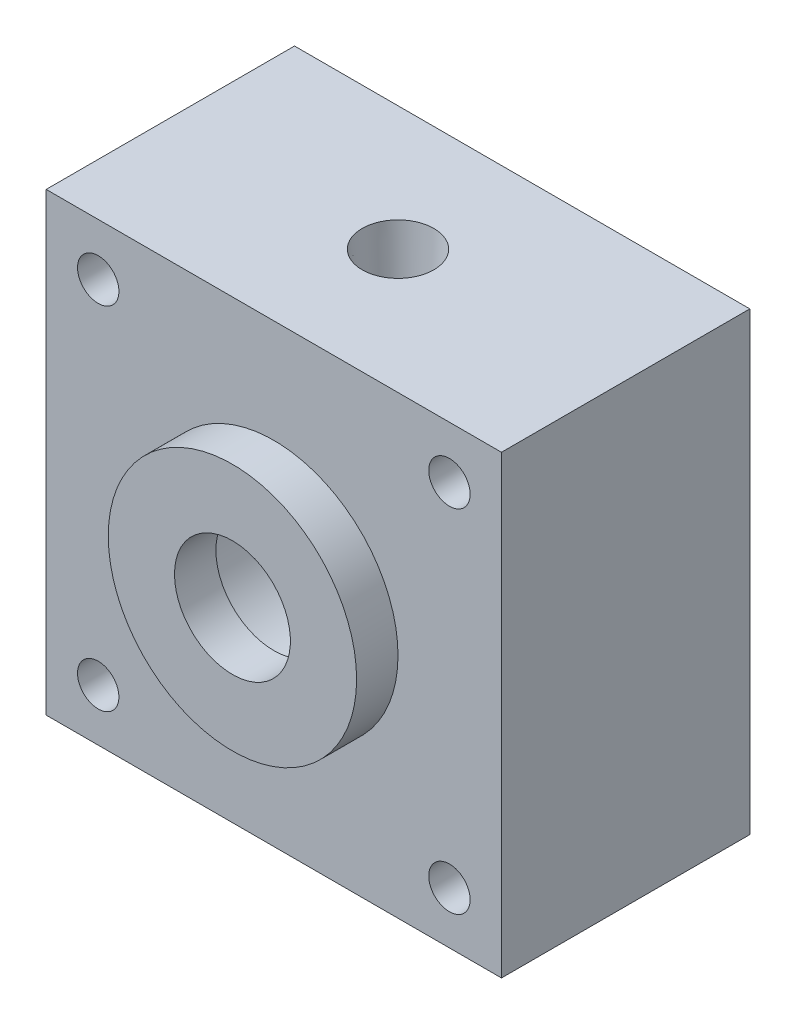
from build123d import *

# Parameters (mm, degrees)
SKETCH1_W           = 34.925
SKETCH1_H           = 34.925
BASE_EXTRUDE_DEPTH  = 19.05
SKETCH12_R          = 15.875
SKETCH12_R_2        = 14.2875
CUT_EXTRUDE4_DEPTH  = 1.524
SKETCH3_R           = 1.5875
CUT_EXTRUDE2_DEPTH  = 32.189426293
CIRPATTERN2_COUNT   = 4
SKETCH15_R          = 9.525
BOSS_EXTRUDE1_DEPTH = 3.175
SKETCH14_R          = 4.445
CUT_EXTRUDE6_DEPTH  = 34.223913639
CUT_EXTRUDE7_START  = -19.05
SKETCH16_R          = 6.35
CUT_EXTRUDE7_DEPTH  = 19.05


with BuildPart() as part:
    # Sketch1 → Base-Extrude (new body)
    with BuildSketch(Plane.XY):
        Rectangle(SKETCH1_W, SKETCH1_H)
    extrude(amount=BASE_EXTRUDE_DEPTH)

    # Sketch12 → Cut-Extrude4 (cut)
    with BuildSketch(Plane(origin=(-5.978518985, 12.821273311, 0), x_dir=(-1, 0, 0), z_dir=(0, 0, -1))):
        with Locations((-5.978518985, -12.821273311)):
            Circle(SKETCH12_R)
        with Locations((-5.978518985, -12.821273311)):
            Circle(SKETCH12_R_2, mode=Mode.SUBTRACT)
    extrude(amount=-CUT_EXTRUDE4_DEPTH, mode=Mode.SUBTRACT)

    # Sketch3 → Cut-Extrude2 (cut, through all)
    with BuildSketch(Plane.XY.offset(19.05)):
        with Locations((13.470384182, 13.470384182)):
            Circle(SKETCH3_R)
    cut_extrude2 = extrude(amount=-CUT_EXTRUDE2_DEPTH, mode=Mode.SUBTRACT)

    # CirPattern2: Cut-Extrude2 ×4 about axis
    cirpattern2_axis = Axis((0, 0, 0), (0, 0, 1))
    for i in range(1, CIRPATTERN2_COUNT):
        add(cut_extrude2.rotate(cirpattern2_axis, i * 360 / CIRPATTERN2_COUNT), mode=Mode.SUBTRACT)

    # Sketch10 → Hole3 (revolve, cut)
    with BuildSketch(Plane(origin=(0, 17.4625, 9.525), x_dir=(0, 0, 1), z_dir=(1, 0, 0))):
        Polygon((0, 0), (0, 7.799876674), (2.413, 6.35), (2.413, 4.826), (2.750466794, 0), align=None)
    revolve(axis=Axis((0, 21.469039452, 9.525), (0, -1, 0)), mode=Mode.SUBTRACT)

    # Sketch15 → Boss-Extrude1 (add)
    with BuildSketch(Plane.XY.offset(19.05)):
        with Locations(Location((0, 0, 0), (0, 0, 180))):
            Circle(SKETCH15_R)
    extrude(amount=BOSS_EXTRUDE1_DEPTH)

    # Sketch14 → Cut-Extrude6 (cut, through all)
    with BuildSketch(Plane(origin=(0, 0, 0), x_dir=(-1, 0, 0), z_dir=(0, 0, -1))):
        Circle(SKETCH14_R)
    extrude(amount=-CUT_EXTRUDE6_DEPTH, mode=Mode.SUBTRACT)

    # Sketch16 → Cut-Extrude7 (cut)
    with BuildSketch(Plane(origin=(0, 0, 0), x_dir=(-1, 0, 0), z_dir=(0, 0, -1)).offset(CUT_EXTRUDE7_START)):
        Circle(SKETCH16_R)
    extrude(amount=CUT_EXTRUDE7_DEPTH, mode=Mode.SUBTRACT)

    # Sketch17 → Cut-Revolve1 (revolve, cut)
    with BuildSketch(Plane(origin=(0, 0, 0), x_dir=(0, 0, -1), z_dir=(1, 0, 0))):
        Polygon((-9.525, 11.1125), (-10.514867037, 10.541), (-4.09906217, -0.5715), (-3.109195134, 0), align=None)
    revolve(axis=Axis((0, 11.1125, 9.525), (0, -0.8660254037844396, -0.4999999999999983)), mode=Mode.SUBTRACT)


solid = part.part
